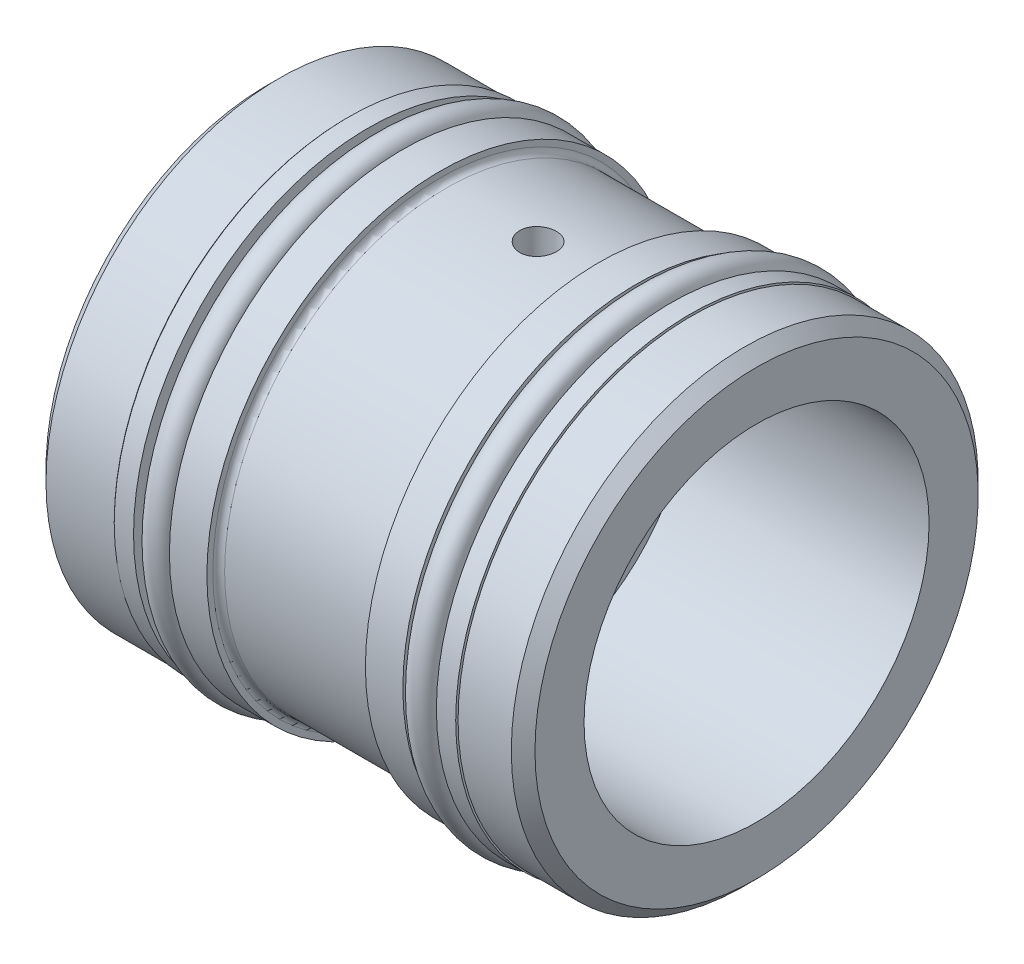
from build123d import *

# Parameters (mm, degrees)
FILLET1_R               = 0.381
CHAMFER1_SIZE           = 0.762
SKETCH6_R               = 0.889
SKETCH6_W               = 1.2446
SKETCH6_H               = 1.3462
CUT_EXTRUDE1_DEPTH      = 27.954678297
CUT_EXTRUDE1_DEPTH_BACK = 27.954678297
SKETCH7_R               = 1.1811


with BuildPart() as part:
    # Sketch1 → Revolve1 (revolve)
    with BuildSketch(Plane.XY, mode=Mode.PRIVATE) as revolve1_sk:
        Polygon((-15.748, 6.35), (-15.748, 15.0368), (-10.5918, 15.0368), (-10.5918, 13.7668), (-7.0358, 13.7668), (-7.0358, 15.0368), (-4.6228, 15.0368), (-4.6228, 14.2748), (5.588, 14.2748), (5.588, 15.0368), (8.001, 15.0368), (8.001, 13.7668), (11.557, 13.7668), (11.557, 15.0368), (15.748, 15.0368), (15.748, 11.1125), (0.3556, 11.1125), (0.3556, 6.35), align=None)
    revolve(revolve1_sk.sketch.rotate(Axis((0, 0, 0), (1, 0, 0)), 90), axis=Axis((0, 0, 0), (1, 0, 0)))

    # Fillet1
    fillet1_edges = [part.edges().sort_by_distance(p)[0] for p in [
        (-4.6228, 0, -14.2748),
        (5.588, 0, -14.2748),
    ]]
    fillet(fillet1_edges, radius=FILLET1_R)

    # Chamfer1
    chamfer1_edges = [part.edges().sort_by_distance(p)[0] for p in [
        (-15.748, 0, -15.0368),
        (15.748, 0, -15.0368),
    ]]
    chamfer(chamfer1_edges, length=CHAMFER1_SIZE)

    # Sketch6 → Revolve3 (revolve)
    with BuildSketch(Plane.XY, mode=Mode.PRIVATE) as revolve3_sk:
        with Locations((-8.001, 14.5796)):
            Circle(SKETCH6_R)
        with Locations((8.9662, 14.5796)):
            Circle(SKETCH6_R)
        with Locations((-9.8933, 14.4399)):
            Rectangle(SKETCH6_W, SKETCH6_H)
        with Locations((10.8585, 14.4399)):
            Rectangle(SKETCH6_W, SKETCH6_H)
    revolve(revolve3_sk.sketch.rotate(Axis((0, 0, 0), (1, 0, 0)), 90), axis=Axis((0, 0, 0), (1, 0, 0)))

    # Sketch7 → Cut-Extrude1 (cut, two sides: drawn at the far end of the back side and taken through both)
    with BuildSketch(Plane(origin=(0, 0, 0), x_dir=(0, 0, -1), z_dir=(0, 1, 0)).offset(-CUT_EXTRUDE1_DEPTH_BACK)):
        with Locations(Location((0, -1.6764, 0), (0, 0, 180))):
            Circle(SKETCH7_R)
    extrude(amount=CUT_EXTRUDE1_DEPTH + CUT_EXTRUDE1_DEPTH_BACK, mode=Mode.SUBTRACT)


solid = part.part
